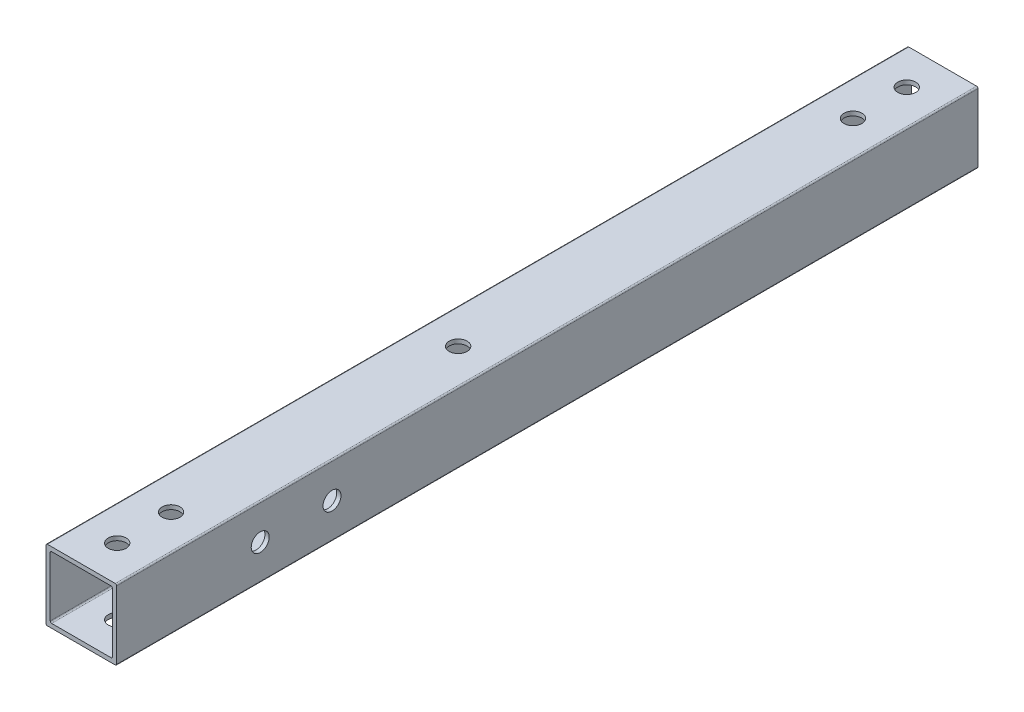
ISO-10303-21;
HEADER;
FILE_DESCRIPTION(('STEP AP214'),'2;1');
FILE_NAME('part.step','',(''),(''),'','','');
FILE_SCHEMA(('AUTOMOTIVE_DESIGN { 1 0 10303 214 1 1 1 1 }'));
ENDSEC;
DATA;
#1=APPLICATION_CONTEXT('core data for automotive mechanical design processes');
#2=APPLICATION_PROTOCOL_DEFINITION('international standard','automotive_design',2000,#1);
#3=PRODUCT_CONTEXT('',#1,'mechanical');
#4=PRODUCT('Part','Part','',(#3));
#5=PRODUCT_RELATED_PRODUCT_CATEGORY('part','',(#4));
#6=PRODUCT_DEFINITION_FORMATION('','',#4);
#7=PRODUCT_DEFINITION_CONTEXT('part definition',#1,'design');
#8=PRODUCT_DEFINITION('design','',#6,#7);
#9=PRODUCT_DEFINITION_SHAPE('','',#8);
#10=(LENGTH_UNIT() NAMED_UNIT(*) SI_UNIT(.MILLI.,.METRE.));
#11=(NAMED_UNIT(*) PLANE_ANGLE_UNIT() SI_UNIT($,.RADIAN.));
#12=(NAMED_UNIT(*) SI_UNIT($,.STERADIAN.) SOLID_ANGLE_UNIT());
#13=UNCERTAINTY_MEASURE_WITH_UNIT(LENGTH_MEASURE(1.E-05),#10,'distance_accuracy_value','');
#14=(GEOMETRIC_REPRESENTATION_CONTEXT(3) GLOBAL_UNCERTAINTY_ASSIGNED_CONTEXT((#13)) GLOBAL_UNIT_ASSIGNED_CONTEXT((#10,
#11,#12)) REPRESENTATION_CONTEXT('',''));
#15=CARTESIAN_POINT('',(0.,0.,0.));
#16=DIRECTION('',(0.,0.,1.));
#17=DIRECTION('',(1.,0.,0.));
#18=AXIS2_PLACEMENT_3D('',#15,#16,#17);
#19=CARTESIAN_POINT('',(-11.9999999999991,-11.9999999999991,-1695.2));
#20=DIRECTION('',(0.,0.,-1.));
#21=DIRECTION('',(-1.,0.,0.));
#22=AXIS2_PLACEMENT_3D('',#19,#20,#21);
#23=CYLINDRICAL_SURFACE('',#22,0.500000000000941);
#24=CARTESIAN_POINT('',(-11.9999999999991,-11.9999999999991,-2000.));
#25=DIRECTION('',(0.,0.,-1.));
#26=DIRECTION('',(-1.,0.,0.));
#27=AXIS2_PLACEMENT_3D('',#24,#25,#26);
#28=CIRCLE('',#27,0.500000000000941);
#29=CARTESIAN_POINT('',(-11.9999999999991,-12.5,-2000.));
#30=VERTEX_POINT('',#29);
#31=CARTESIAN_POINT('',(-12.5,-11.9999999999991,-2000.));
#32=VERTEX_POINT('',#31);
#33=EDGE_CURVE('E217',#30,#32,#28,.T.);
#34=ORIENTED_EDGE('',*,*,#33,.F.);
#35=DIRECTION('',(0.,0.,-1.));
#36=VECTOR('',#35,1.);
#37=CARTESIAN_POINT('',(-11.9999999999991,-12.5,-1695.2));
#38=LINE('',#37,#36);
#39=CARTESIAN_POINT('',(-11.9999999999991,-12.5,-1695.2));
#40=VERTEX_POINT('',#39);
#41=EDGE_CURVE('E11',#40,#30,#38,.T.);
#42=ORIENTED_EDGE('',*,*,#41,.F.);
#43=CARTESIAN_POINT('',(-11.9999999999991,-11.9999999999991,-1695.2));
#44=DIRECTION('',(0.,0.,-1.));
#45=DIRECTION('',(-1.,0.,0.));
#46=AXIS2_PLACEMENT_3D('',#43,#44,#45);
#47=CIRCLE('',#46,0.500000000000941);
#48=CARTESIAN_POINT('',(-12.5,-11.9999999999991,-1695.2));
#49=VERTEX_POINT('',#48);
#50=EDGE_CURVE('E229',#40,#49,#47,.T.);
#51=ORIENTED_EDGE('',*,*,#50,.T.);
#52=DIRECTION('',(0.,0.,-1.));
#53=VECTOR('',#52,1.);
#54=CARTESIAN_POINT('',(-12.5,-11.9999999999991,-1695.2));
#55=LINE('',#54,#53);
#56=EDGE_CURVE('E254',#49,#32,#55,.T.);
#57=ORIENTED_EDGE('',*,*,#56,.T.);
#58=EDGE_LOOP('',(#34,#42,#51,#57));
#59=FACE_BOUND('',#58,.T.);
#60=ADVANCED_FACE('F44',(#59),#23,.T.);
#61=CARTESIAN_POINT('',(11.9999999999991,-12.5,-1695.2));
#62=DIRECTION('',(0.,-1.,0.));
#63=DIRECTION('',(1.,0.,0.));
#64=AXIS2_PLACEMENT_3D('',#61,#62,#63);
#65=PLANE('',#64);
#66=CARTESIAN_POINT('',(0.,-12.5,-1828.55));
#67=DIRECTION('',(0.,-1.,0.));
#68=DIRECTION('',(1.,0.,0.));
#69=AXIS2_PLACEMENT_3D('',#66,#67,#68);
#70=CIRCLE('',#69,3.17500000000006);
#71=CARTESIAN_POINT('',(3.17500000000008,-12.5,-1828.55));
#72=VERTEX_POINT('',#71);
#73=EDGE_CURVE('E455',#72,#72,#70,.F.);
#74=ORIENTED_EDGE('',*,*,#73,.T.);
#75=EDGE_LOOP('',(#74));
#76=FACE_BOUND('',#75,.T.);
#77=CARTESIAN_POINT('',(0.,-12.5,-1987.3));
#78=DIRECTION('',(0.,-1.,0.));
#79=DIRECTION('',(1.,0.,0.));
#80=AXIS2_PLACEMENT_3D('',#77,#78,#79);
#81=CIRCLE('',#80,3.17500000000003);
#82=CARTESIAN_POINT('',(3.17500000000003,-12.5,-1987.3));
#83=VERTEX_POINT('',#82);
#84=EDGE_CURVE('E293',#83,#83,#81,.F.);
#85=ORIENTED_EDGE('',*,*,#84,.T.);
#86=EDGE_LOOP('',(#85));
#87=FACE_BOUND('',#86,.T.);
#88=CARTESIAN_POINT('',(0.,-12.5,-1726.95));
#89=DIRECTION('',(0.,-1.,0.));
#90=DIRECTION('',(1.,0.,0.));
#91=AXIS2_PLACEMENT_3D('',#88,#89,#90);
#92=CIRCLE('',#91,3.17500000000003);
#93=CARTESIAN_POINT('',(3.17500000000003,-12.5,-1726.95));
#94=VERTEX_POINT('',#93);
#95=EDGE_CURVE('E315',#94,#94,#92,.F.);
#96=ORIENTED_EDGE('',*,*,#95,.T.);
#97=EDGE_LOOP('',(#96));
#98=FACE_BOUND('',#97,.T.);
#99=CARTESIAN_POINT('',(0.,-12.5,-1707.9));
#100=DIRECTION('',(0.,-1.,0.));
#101=DIRECTION('',(1.,0.,0.));
#102=AXIS2_PLACEMENT_3D('',#99,#100,#101);
#103=CIRCLE('',#102,3.17500000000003);
#104=CARTESIAN_POINT('',(3.17500000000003,-12.5,-1707.9));
#105=VERTEX_POINT('',#104);
#106=EDGE_CURVE('E336',#105,#105,#103,.F.);
#107=ORIENTED_EDGE('',*,*,#106,.T.);
#108=EDGE_LOOP('',(#107));
#109=FACE_BOUND('',#108,.T.);
#110=CARTESIAN_POINT('',(0.,-12.5,-1968.25));
#111=DIRECTION('',(0.,-1.,0.));
#112=DIRECTION('',(1.,0.,0.));
#113=AXIS2_PLACEMENT_3D('',#110,#111,#112);
#114=CIRCLE('',#113,3.17500000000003);
#115=CARTESIAN_POINT('',(3.17500000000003,-12.5,-1968.25));
#116=VERTEX_POINT('',#115);
#117=EDGE_CURVE('E337',#116,#116,#114,.F.);
#118=ORIENTED_EDGE('',*,*,#117,.T.);
#119=EDGE_LOOP('',(#118));
#120=FACE_BOUND('',#119,.T.);
#121=DIRECTION('',(-1.,0.,0.));
#122=VECTOR('',#121,1.);
#123=CARTESIAN_POINT('',(11.9999999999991,-12.5,-2000.));
#124=LINE('',#123,#122);
#125=CARTESIAN_POINT('',(11.9999999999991,-12.5,-2000.));
#126=VERTEX_POINT('',#125);
#127=EDGE_CURVE('E233',#126,#30,#124,.T.);
#128=ORIENTED_EDGE('',*,*,#127,.F.);
#129=DIRECTION('',(0.,0.,-1.));
#130=VECTOR('',#129,1.);
#131=CARTESIAN_POINT('',(11.9999999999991,-12.5,-1695.2));
#132=LINE('',#131,#130);
#133=CARTESIAN_POINT('',(11.9999999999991,-12.5,-1695.2));
#134=VERTEX_POINT('',#133);
#135=EDGE_CURVE('E52',#134,#126,#132,.T.);
#136=ORIENTED_EDGE('',*,*,#135,.F.);
#137=DIRECTION('',(-1.,0.,0.));
#138=VECTOR('',#137,1.);
#139=CARTESIAN_POINT('',(11.9999999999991,-12.5,-1695.2));
#140=LINE('',#139,#138);
#141=EDGE_CURVE('E251',#134,#40,#140,.T.);
#142=ORIENTED_EDGE('',*,*,#141,.T.);
#143=ORIENTED_EDGE('',*,*,#41,.T.);
#144=EDGE_LOOP('',(#128,#136,#142,#143));
#145=FACE_BOUND('',#144,.T.);
#146=ADVANCED_FACE('F380',(#76,#87,#98,#109,#120,#145),#65,.T.);
#147=CARTESIAN_POINT('',(11.9999999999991,-11.9999999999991,-1695.2));
#148=DIRECTION('',(0.,0.,-1.));
#149=DIRECTION('',(-1.,0.,0.));
#150=AXIS2_PLACEMENT_3D('',#147,#148,#149);
#151=CYLINDRICAL_SURFACE('',#150,0.500000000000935);
#152=CARTESIAN_POINT('',(11.9999999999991,-11.9999999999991,-2000.));
#153=DIRECTION('',(0.,0.,-1.));
#154=DIRECTION('',(-1.,0.,0.));
#155=AXIS2_PLACEMENT_3D('',#152,#153,#154);
#156=CIRCLE('',#155,0.500000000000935);
#157=CARTESIAN_POINT('',(12.5,-11.9999999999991,-2000.));
#158=VERTEX_POINT('',#157);
#159=EDGE_CURVE('E272',#158,#126,#156,.T.);
#160=ORIENTED_EDGE('',*,*,#159,.F.);
#161=DIRECTION('',(0.,0.,-1.));
#162=VECTOR('',#161,1.);
#163=CARTESIAN_POINT('',(12.5,-11.9999999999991,-1695.2));
#164=LINE('',#163,#162);
#165=CARTESIAN_POINT('',(12.5,-11.9999999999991,-1695.2));
#166=VERTEX_POINT('',#165);
#167=EDGE_CURVE('E278',#166,#158,#164,.T.);
#168=ORIENTED_EDGE('',*,*,#167,.F.);
#169=CARTESIAN_POINT('',(11.9999999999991,-11.9999999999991,-1695.2));
#170=DIRECTION('',(0.,0.,-1.));
#171=DIRECTION('',(-1.,0.,0.));
#172=AXIS2_PLACEMENT_3D('',#169,#170,#171);
#173=CIRCLE('',#172,0.500000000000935);
#174=EDGE_CURVE('E248',#166,#134,#173,.T.);
#175=ORIENTED_EDGE('',*,*,#174,.T.);
#176=ORIENTED_EDGE('',*,*,#135,.T.);
#177=EDGE_LOOP('',(#160,#168,#175,#176));
#178=FACE_BOUND('',#177,.T.);
#179=ADVANCED_FACE('F385',(#178),#151,.T.);
#180=CARTESIAN_POINT('',(12.5,11.9999999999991,-1695.2));
#181=DIRECTION('',(1.,0.,0.));
#182=DIRECTION('',(0.,1.,0.));
#183=AXIS2_PLACEMENT_3D('',#180,#181,#182);
#184=PLANE('',#183);
#185=CARTESIAN_POINT('',(12.5,0.,-1771.4));
#186=DIRECTION('',(1.,0.,0.));
#187=DIRECTION('',(0.,1.,0.));
#188=AXIS2_PLACEMENT_3D('',#185,#186,#187);
#189=CIRCLE('',#188,3.17499999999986);
#190=CARTESIAN_POINT('',(12.5,3.17499999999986,-1771.4));
#191=VERTEX_POINT('',#190);
#192=EDGE_CURVE('E448',#191,#191,#189,.T.);
#193=ORIENTED_EDGE('',*,*,#192,.F.);
#194=EDGE_LOOP('',(#193));
#195=FACE_BOUND('',#194,.T.);
#196=CARTESIAN_POINT('',(12.5,0.,-1746.));
#197=DIRECTION('',(1.,0.,0.));
#198=DIRECTION('',(0.,1.,0.));
#199=AXIS2_PLACEMENT_3D('',#196,#197,#198);
#200=CIRCLE('',#199,3.17499999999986);
#201=CARTESIAN_POINT('',(12.5,3.17499999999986,-1746.));
#202=VERTEX_POINT('',#201);
#203=EDGE_CURVE('E322',#202,#202,#200,.T.);
#204=ORIENTED_EDGE('',*,*,#203,.F.);
#205=EDGE_LOOP('',(#204));
#206=FACE_BOUND('',#205,.T.);
#207=DIRECTION('',(0.,-1.,0.));
#208=VECTOR('',#207,1.);
#209=CARTESIAN_POINT('',(12.5,11.9999999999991,-2000.));
#210=LINE('',#209,#208);
#211=CARTESIAN_POINT('',(12.5,11.9999999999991,-2000.));
#212=VERTEX_POINT('',#211);
#213=EDGE_CURVE('E269',#212,#158,#210,.T.);
#214=ORIENTED_EDGE('',*,*,#213,.F.);
#215=DIRECTION('',(0.,0.,-1.));
#216=VECTOR('',#215,1.);
#217=CARTESIAN_POINT('',(12.5,11.9999999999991,-1695.2));
#218=LINE('',#217,#216);
#219=CARTESIAN_POINT('',(12.5,11.9999999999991,-1695.2));
#220=VERTEX_POINT('',#219);
#221=EDGE_CURVE('E280',#220,#212,#218,.T.);
#222=ORIENTED_EDGE('',*,*,#221,.F.);
#223=DIRECTION('',(0.,-1.,0.));
#224=VECTOR('',#223,1.);
#225=CARTESIAN_POINT('',(12.5,11.9999999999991,-1695.2));
#226=LINE('',#225,#224);
#227=EDGE_CURVE('E245',#220,#166,#226,.T.);
#228=ORIENTED_EDGE('',*,*,#227,.T.);
#229=ORIENTED_EDGE('',*,*,#167,.T.);
#230=EDGE_LOOP('',(#214,#222,#228,#229));
#231=FACE_BOUND('',#230,.T.);
#232=ADVANCED_FACE('F416',(#195,#206,#231),#184,.T.);
#233=CARTESIAN_POINT('',(11.9999999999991,11.9999999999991,-1695.2));
#234=DIRECTION('',(0.,0.,-1.));
#235=DIRECTION('',(-1.,0.,0.));
#236=AXIS2_PLACEMENT_3D('',#233,#234,#235);
#237=CYLINDRICAL_SURFACE('',#236,0.500000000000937);
#238=CARTESIAN_POINT('',(11.9999999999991,11.9999999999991,-2000.));
#239=DIRECTION('',(0.,0.,-1.));
#240=DIRECTION('',(-1.,0.,0.));
#241=AXIS2_PLACEMENT_3D('',#238,#239,#240);
#242=CIRCLE('',#241,0.500000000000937);
#243=CARTESIAN_POINT('',(11.9999999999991,12.5,-2000.));
#244=VERTEX_POINT('',#243);
#245=EDGE_CURVE('E266',#244,#212,#242,.T.);
#246=ORIENTED_EDGE('',*,*,#245,.F.);
#247=DIRECTION('',(0.,0.,-1.));
#248=VECTOR('',#247,1.);
#249=CARTESIAN_POINT('',(11.9999999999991,12.5,-1695.2));
#250=LINE('',#249,#248);
#251=CARTESIAN_POINT('',(11.9999999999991,12.5,-1695.2));
#252=VERTEX_POINT('',#251);
#253=EDGE_CURVE('E282',#252,#244,#250,.T.);
#254=ORIENTED_EDGE('',*,*,#253,.F.);
#255=CARTESIAN_POINT('',(11.9999999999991,11.9999999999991,-1695.2));
#256=DIRECTION('',(0.,0.,-1.));
#257=DIRECTION('',(-1.,0.,0.));
#258=AXIS2_PLACEMENT_3D('',#255,#256,#257);
#259=CIRCLE('',#258,0.500000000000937);
#260=EDGE_CURVE('E242',#252,#220,#259,.T.);
#261=ORIENTED_EDGE('',*,*,#260,.T.);
#262=ORIENTED_EDGE('',*,*,#221,.T.);
#263=EDGE_LOOP('',(#246,#254,#261,#262));
#264=FACE_BOUND('',#263,.T.);
#265=ADVANCED_FACE('F413',(#264),#237,.T.);
#266=CARTESIAN_POINT('',(-11.9999999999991,12.5,-1695.2));
#267=DIRECTION('',(0.,1.,0.));
#268=DIRECTION('',(-1.,0.,0.));
#269=AXIS2_PLACEMENT_3D('',#266,#267,#268);
#270=PLANE('',#269);
#271=CARTESIAN_POINT('',(0.,12.5,-1828.55));
#272=DIRECTION('',(0.,1.,0.));
#273=DIRECTION('',(-1.,0.,0.));
#274=AXIS2_PLACEMENT_3D('',#271,#272,#273);
#275=CIRCLE('',#274,3.17500000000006);
#276=CARTESIAN_POINT('',(-3.17500000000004,12.5,-1828.55));
#277=VERTEX_POINT('',#276);
#278=EDGE_CURVE('E458',#277,#277,#275,.T.);
#279=ORIENTED_EDGE('',*,*,#278,.F.);
#280=EDGE_LOOP('',(#279));
#281=FACE_BOUND('',#280,.T.);
#282=CARTESIAN_POINT('',(0.,12.5,-1987.3));
#283=DIRECTION('',(0.,1.,0.));
#284=DIRECTION('',(-1.,0.,0.));
#285=AXIS2_PLACEMENT_3D('',#282,#283,#284);
#286=CIRCLE('',#285,3.17500000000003);
#287=CARTESIAN_POINT('',(-3.17500000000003,12.5,-1987.3));
#288=VERTEX_POINT('',#287);
#289=EDGE_CURVE('E325',#288,#288,#286,.T.);
#290=ORIENTED_EDGE('',*,*,#289,.F.);
#291=EDGE_LOOP('',(#290));
#292=FACE_BOUND('',#291,.T.);
#293=CARTESIAN_POINT('',(0.,12.5,-1726.95));
#294=DIRECTION('',(0.,1.,0.));
#295=DIRECTION('',(1.,0.,0.));
#296=AXIS2_PLACEMENT_3D('',#293,#294,#295);
#297=CIRCLE('',#296,3.17500000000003);
#298=CARTESIAN_POINT('',(3.17500000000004,12.5,-1726.95));
#299=VERTEX_POINT('',#298);
#300=EDGE_CURVE('E333',#299,#299,#297,.T.);
#301=ORIENTED_EDGE('',*,*,#300,.F.);
#302=EDGE_LOOP('',(#301));
#303=FACE_BOUND('',#302,.T.);
#304=CARTESIAN_POINT('',(0.,12.5,-1707.9));
#305=DIRECTION('',(0.,1.,0.));
#306=DIRECTION('',(1.,0.,0.));
#307=AXIS2_PLACEMENT_3D('',#304,#305,#306);
#308=CIRCLE('',#307,3.17500000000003);
#309=CARTESIAN_POINT('',(3.17500000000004,12.5,-1707.9));
#310=VERTEX_POINT('',#309);
#311=EDGE_CURVE('E340',#310,#310,#308,.T.);
#312=ORIENTED_EDGE('',*,*,#311,.F.);
#313=EDGE_LOOP('',(#312));
#314=FACE_BOUND('',#313,.T.);
#315=CARTESIAN_POINT('',(0.,12.5,-1968.25));
#316=DIRECTION('',(0.,1.,0.));
#317=DIRECTION('',(-1.,0.,0.));
#318=AXIS2_PLACEMENT_3D('',#315,#316,#317);
#319=CIRCLE('',#318,3.17500000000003);
#320=CARTESIAN_POINT('',(-3.17500000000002,12.5,-1968.25));
#321=VERTEX_POINT('',#320);
#322=EDGE_CURVE('E328',#321,#321,#319,.T.);
#323=ORIENTED_EDGE('',*,*,#322,.F.);
#324=EDGE_LOOP('',(#323));
#325=FACE_BOUND('',#324,.T.);
#326=DIRECTION('',(1.,0.,0.));
#327=VECTOR('',#326,1.);
#328=CARTESIAN_POINT('',(-11.9999999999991,12.5,-2000.));
#329=LINE('',#328,#327);
#330=CARTESIAN_POINT('',(-11.9999999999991,12.5,-2000.));
#331=VERTEX_POINT('',#330);
#332=EDGE_CURVE('E263',#331,#244,#329,.T.);
#333=ORIENTED_EDGE('',*,*,#332,.F.);
#334=DIRECTION('',(0.,0.,-1.));
#335=VECTOR('',#334,1.);
#336=CARTESIAN_POINT('',(-11.9999999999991,12.5,-1695.2));
#337=LINE('',#336,#335);
#338=CARTESIAN_POINT('',(-11.9999999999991,12.5,-1695.2));
#339=VERTEX_POINT('',#338);
#340=EDGE_CURVE('E284',#339,#331,#337,.T.);
#341=ORIENTED_EDGE('',*,*,#340,.F.);
#342=DIRECTION('',(1.,0.,0.));
#343=VECTOR('',#342,1.);
#344=CARTESIAN_POINT('',(-11.9999999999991,12.5,-1695.2));
#345=LINE('',#344,#343);
#346=EDGE_CURVE('E239',#339,#252,#345,.T.);
#347=ORIENTED_EDGE('',*,*,#346,.T.);
#348=ORIENTED_EDGE('',*,*,#253,.T.);
#349=EDGE_LOOP('',(#333,#341,#347,#348));
#350=FACE_BOUND('',#349,.T.);
#351=ADVANCED_FACE('F409',(#281,#292,#303,#314,#325,#350),#270,.T.);
#352=CARTESIAN_POINT('',(-11.9999999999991,11.9999999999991,-1695.2));
#353=DIRECTION('',(0.,0.,-1.));
#354=DIRECTION('',(-1.,0.,0.));
#355=AXIS2_PLACEMENT_3D('',#352,#353,#354);
#356=CYLINDRICAL_SURFACE('',#355,0.500000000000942);
#357=CARTESIAN_POINT('',(-11.9999999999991,11.9999999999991,-2000.));
#358=DIRECTION('',(0.,0.,-1.));
#359=DIRECTION('',(-1.,0.,0.));
#360=AXIS2_PLACEMENT_3D('',#357,#358,#359);
#361=CIRCLE('',#360,0.500000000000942);
#362=CARTESIAN_POINT('',(-12.5,11.9999999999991,-2000.));
#363=VERTEX_POINT('',#362);
#364=EDGE_CURVE('E260',#363,#331,#361,.T.);
#365=ORIENTED_EDGE('',*,*,#364,.F.);
#366=DIRECTION('',(0.,0.,-1.));
#367=VECTOR('',#366,1.);
#368=CARTESIAN_POINT('',(-12.5,11.9999999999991,-1695.2));
#369=LINE('',#368,#367);
#370=CARTESIAN_POINT('',(-12.5,11.9999999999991,-1695.2));
#371=VERTEX_POINT('',#370);
#372=EDGE_CURVE('E286',#371,#363,#369,.T.);
#373=ORIENTED_EDGE('',*,*,#372,.F.);
#374=CARTESIAN_POINT('',(-11.9999999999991,11.9999999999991,-1695.2));
#375=DIRECTION('',(0.,0.,-1.));
#376=DIRECTION('',(-1.,0.,0.));
#377=AXIS2_PLACEMENT_3D('',#374,#375,#376);
#378=CIRCLE('',#377,0.500000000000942);
#379=EDGE_CURVE('E236',#371,#339,#378,.T.);
#380=ORIENTED_EDGE('',*,*,#379,.T.);
#381=ORIENTED_EDGE('',*,*,#340,.T.);
#382=EDGE_LOOP('',(#365,#373,#380,#381));
#383=FACE_BOUND('',#382,.T.);
#384=ADVANCED_FACE('F407',(#383),#356,.T.);
#385=CARTESIAN_POINT('',(-12.5,-11.9999999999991,-1695.2));
#386=DIRECTION('',(-1.,0.,0.));
#387=DIRECTION('',(0.,0.,1.));
#388=AXIS2_PLACEMENT_3D('',#385,#386,#387);
#389=PLANE('',#388);
#390=CARTESIAN_POINT('',(-12.5,0.,-1771.4));
#391=DIRECTION('',(-1.,0.,0.));
#392=DIRECTION('',(0.,0.,1.));
#393=AXIS2_PLACEMENT_3D('',#390,#391,#392);
#394=CIRCLE('',#393,3.17499999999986);
#395=CARTESIAN_POINT('',(-12.5,3.17499999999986,-1771.4));
#396=VERTEX_POINT('',#395);
#397=EDGE_CURVE('E308',#396,#396,#394,.F.);
#398=ORIENTED_EDGE('',*,*,#397,.T.);
#399=EDGE_LOOP('',(#398));
#400=FACE_BOUND('',#399,.T.);
#401=CARTESIAN_POINT('',(-12.5,0.,-1746.));
#402=DIRECTION('',(-1.,0.,0.));
#403=DIRECTION('',(0.,0.,1.));
#404=AXIS2_PLACEMENT_3D('',#401,#402,#403);
#405=CIRCLE('',#404,3.17499999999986);
#406=CARTESIAN_POINT('',(-12.5,3.17499999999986,-1746.));
#407=VERTEX_POINT('',#406);
#408=EDGE_CURVE('E444',#407,#407,#405,.F.);
#409=ORIENTED_EDGE('',*,*,#408,.T.);
#410=EDGE_LOOP('',(#409));
#411=FACE_BOUND('',#410,.T.);
#412=DIRECTION('',(0.,1.,0.));
#413=VECTOR('',#412,1.);
#414=CARTESIAN_POINT('',(-12.5,-11.9999999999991,-2000.));
#415=LINE('',#414,#413);
#416=EDGE_CURVE('E257',#32,#363,#415,.T.);
#417=ORIENTED_EDGE('',*,*,#416,.F.);
#418=ORIENTED_EDGE('',*,*,#56,.F.);
#419=DIRECTION('',(0.,1.,0.));
#420=VECTOR('',#419,1.);
#421=CARTESIAN_POINT('',(-12.5,-11.9999999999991,-1695.2));
#422=LINE('',#421,#420);
#423=EDGE_CURVE('E232',#49,#371,#422,.T.);
#424=ORIENTED_EDGE('',*,*,#423,.T.);
#425=ORIENTED_EDGE('',*,*,#372,.T.);
#426=EDGE_LOOP('',(#417,#418,#424,#425));
#427=FACE_BOUND('',#426,.T.);
#428=ADVANCED_FACE('F403',(#400,#411,#427),#389,.T.);
#429=CARTESIAN_POINT('',(-11.9999999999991,-11.9999999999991,-1695.2));
#430=DIRECTION('',(0.,0.,-1.));
#431=DIRECTION('',(-1.,0.,0.));
#432=AXIS2_PLACEMENT_3D('',#429,#430,#431);
#433=PLANE('',#432);
#434=DIRECTION('',(0.,1.,0.));
#435=VECTOR('',#434,1.);
#436=CARTESIAN_POINT('',(-11.,10.4999999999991,-1695.2));
#437=LINE('',#436,#435);
#438=CARTESIAN_POINT('',(-11.,-10.4999999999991,-1695.2));
#439=VERTEX_POINT('',#438);
#440=CARTESIAN_POINT('',(-11.,10.4999999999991,-1695.2));
#441=VERTEX_POINT('',#440);
#442=EDGE_CURVE('E165',#439,#441,#437,.T.);
#443=ORIENTED_EDGE('',*,*,#442,.T.);
#444=CARTESIAN_POINT('',(-10.4999999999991,10.4999999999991,-1695.2));
#445=DIRECTION('',(0.,0.,-1.));
#446=DIRECTION('',(1.,0.,0.));
#447=AXIS2_PLACEMENT_3D('',#444,#445,#446);
#448=CIRCLE('',#447,0.500000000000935);
#449=CARTESIAN_POINT('',(-10.4999999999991,11.,-1695.2));
#450=VERTEX_POINT('',#449);
#451=EDGE_CURVE('E159',#441,#450,#448,.T.);
#452=ORIENTED_EDGE('',*,*,#451,.T.);
#453=DIRECTION('',(1.,0.,0.));
#454=VECTOR('',#453,1.);
#455=CARTESIAN_POINT('',(10.4999999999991,11.,-1695.2));
#456=LINE('',#455,#454);
#457=CARTESIAN_POINT('',(10.4999999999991,11.,-1695.2));
#458=VERTEX_POINT('',#457);
#459=EDGE_CURVE('E168',#450,#458,#456,.T.);
#460=ORIENTED_EDGE('',*,*,#459,.T.);
#461=CARTESIAN_POINT('',(10.4999999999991,10.4999999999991,-1695.2));
#462=DIRECTION('',(0.,0.,-1.));
#463=DIRECTION('',(1.,0.,0.));
#464=AXIS2_PLACEMENT_3D('',#461,#462,#463);
#465=CIRCLE('',#464,0.500000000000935);
#466=CARTESIAN_POINT('',(11.,10.4999999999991,-1695.2));
#467=VERTEX_POINT('',#466);
#468=EDGE_CURVE('E60',#458,#467,#465,.T.);
#469=ORIENTED_EDGE('',*,*,#468,.T.);
#470=DIRECTION('',(0.,-1.,0.));
#471=VECTOR('',#470,1.);
#472=CARTESIAN_POINT('',(11.,-10.4999999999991,-1695.2));
#473=LINE('',#472,#471);
#474=CARTESIAN_POINT('',(11.,-10.4999999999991,-1695.2));
#475=VERTEX_POINT('',#474);
#476=EDGE_CURVE('E186',#467,#475,#473,.T.);
#477=ORIENTED_EDGE('',*,*,#476,.T.);
#478=CARTESIAN_POINT('',(10.4999999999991,-10.4999999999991,-1695.2));
#479=DIRECTION('',(0.,0.,-1.));
#480=DIRECTION('',(1.,0.,0.));
#481=AXIS2_PLACEMENT_3D('',#478,#479,#480);
#482=CIRCLE('',#481,0.500000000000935);
#483=CARTESIAN_POINT('',(10.4999999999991,-11.,-1695.2));
#484=VERTEX_POINT('',#483);
#485=EDGE_CURVE('E189',#475,#484,#482,.T.);
#486=ORIENTED_EDGE('',*,*,#485,.T.);
#487=DIRECTION('',(-1.,0.,0.));
#488=VECTOR('',#487,1.);
#489=CARTESIAN_POINT('',(-10.4999999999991,-11.,-1695.2));
#490=LINE('',#489,#488);
#491=CARTESIAN_POINT('',(-10.4999999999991,-11.,-1695.2));
#492=VERTEX_POINT('',#491);
#493=EDGE_CURVE('E192',#484,#492,#490,.T.);
#494=ORIENTED_EDGE('',*,*,#493,.T.);
#495=CARTESIAN_POINT('',(-10.4999999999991,-10.4999999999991,-1695.2));
#496=DIRECTION('',(0.,0.,-1.));
#497=DIRECTION('',(1.,0.,0.));
#498=AXIS2_PLACEMENT_3D('',#495,#496,#497);
#499=CIRCLE('',#498,0.500000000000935);
#500=EDGE_CURVE('E195',#492,#439,#499,.T.);
#501=ORIENTED_EDGE('',*,*,#500,.T.);
#502=EDGE_LOOP('',(#443,#452,#460,#469,#477,#486,#494,#501));
#503=FACE_BOUND('',#502,.T.);
#504=ORIENTED_EDGE('',*,*,#50,.F.);
#505=ORIENTED_EDGE('',*,*,#141,.F.);
#506=ORIENTED_EDGE('',*,*,#174,.F.);
#507=ORIENTED_EDGE('',*,*,#227,.F.);
#508=ORIENTED_EDGE('',*,*,#260,.F.);
#509=ORIENTED_EDGE('',*,*,#346,.F.);
#510=ORIENTED_EDGE('',*,*,#379,.F.);
#511=ORIENTED_EDGE('',*,*,#423,.F.);
#512=EDGE_LOOP('',(#504,#505,#506,#507,#508,#509,#510,#511));
#513=FACE_BOUND('',#512,.T.);
#514=ADVANCED_FACE('F172',(#503,#513),#433,.F.);
#515=CARTESIAN_POINT('',(-11.9999999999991,-11.9999999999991,-2000.));
#516=DIRECTION('',(0.,0.,-1.));
#517=DIRECTION('',(-1.,0.,0.));
#518=AXIS2_PLACEMENT_3D('',#515,#516,#517);
#519=PLANE('',#518);
#520=CARTESIAN_POINT('',(-10.4999999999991,10.4999999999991,-2000.));
#521=DIRECTION('',(0.,0.,-1.));
#522=DIRECTION('',(1.,0.,0.));
#523=AXIS2_PLACEMENT_3D('',#520,#521,#522);
#524=CIRCLE('',#523,0.500000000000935);
#525=CARTESIAN_POINT('',(-11.,10.4999999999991,-2000.));
#526=VERTEX_POINT('',#525);
#527=CARTESIAN_POINT('',(-10.4999999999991,11.,-2000.));
#528=VERTEX_POINT('',#527);
#529=EDGE_CURVE('E68',#526,#528,#524,.T.);
#530=ORIENTED_EDGE('',*,*,#529,.F.);
#531=DIRECTION('',(0.,1.,0.));
#532=VECTOR('',#531,1.);
#533=CARTESIAN_POINT('',(-11.,10.4999999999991,-2000.));
#534=LINE('',#533,#532);
#535=CARTESIAN_POINT('',(-11.,-10.4999999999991,-2000.));
#536=VERTEX_POINT('',#535);
#537=EDGE_CURVE('E176',#536,#526,#534,.T.);
#538=ORIENTED_EDGE('',*,*,#537,.F.);
#539=CARTESIAN_POINT('',(-10.4999999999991,-10.4999999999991,-2000.));
#540=DIRECTION('',(0.,0.,-1.));
#541=DIRECTION('',(1.,0.,0.));
#542=AXIS2_PLACEMENT_3D('',#539,#540,#541);
#543=CIRCLE('',#542,0.500000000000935);
#544=CARTESIAN_POINT('',(-10.4999999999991,-11.,-2000.));
#545=VERTEX_POINT('',#544);
#546=EDGE_CURVE('E179',#545,#536,#543,.T.);
#547=ORIENTED_EDGE('',*,*,#546,.F.);
#548=DIRECTION('',(-1.,0.,0.));
#549=VECTOR('',#548,1.);
#550=CARTESIAN_POINT('',(-10.4999999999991,-11.,-2000.));
#551=LINE('',#550,#549);
#552=CARTESIAN_POINT('',(10.4999999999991,-11.,-2000.));
#553=VERTEX_POINT('',#552);
#554=EDGE_CURVE('E210',#553,#545,#551,.T.);
#555=ORIENTED_EDGE('',*,*,#554,.F.);
#556=CARTESIAN_POINT('',(10.4999999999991,-10.4999999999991,-2000.));
#557=DIRECTION('',(0.,0.,-1.));
#558=DIRECTION('',(1.,0.,0.));
#559=AXIS2_PLACEMENT_3D('',#556,#557,#558);
#560=CIRCLE('',#559,0.500000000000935);
#561=CARTESIAN_POINT('',(11.,-10.4999999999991,-2000.));
#562=VERTEX_POINT('',#561);
#563=EDGE_CURVE('E207',#562,#553,#560,.T.);
#564=ORIENTED_EDGE('',*,*,#563,.F.);
#565=DIRECTION('',(0.,-1.,0.));
#566=VECTOR('',#565,1.);
#567=CARTESIAN_POINT('',(11.,-10.4999999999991,-2000.));
#568=LINE('',#567,#566);
#569=CARTESIAN_POINT('',(11.,10.4999999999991,-2000.));
#570=VERTEX_POINT('',#569);
#571=EDGE_CURVE('E204',#570,#562,#568,.T.);
#572=ORIENTED_EDGE('',*,*,#571,.F.);
#573=CARTESIAN_POINT('',(10.4999999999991,10.4999999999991,-2000.));
#574=DIRECTION('',(0.,0.,-1.));
#575=DIRECTION('',(1.,0.,0.));
#576=AXIS2_PLACEMENT_3D('',#573,#574,#575);
#577=CIRCLE('',#576,0.500000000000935);
#578=CARTESIAN_POINT('',(10.4999999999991,11.,-2000.));
#579=VERTEX_POINT('',#578);
#580=EDGE_CURVE('E201',#579,#570,#577,.T.);
#581=ORIENTED_EDGE('',*,*,#580,.F.);
#582=DIRECTION('',(1.,0.,0.));
#583=VECTOR('',#582,1.);
#584=CARTESIAN_POINT('',(10.4999999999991,11.,-2000.));
#585=LINE('',#584,#583);
#586=EDGE_CURVE('E199',#528,#579,#585,.T.);
#587=ORIENTED_EDGE('',*,*,#586,.F.);
#588=EDGE_LOOP('',(#530,#538,#547,#555,#564,#572,#581,#587));
#589=FACE_BOUND('',#588,.T.);
#590=ORIENTED_EDGE('',*,*,#33,.T.);
#591=ORIENTED_EDGE('',*,*,#416,.T.);
#592=ORIENTED_EDGE('',*,*,#364,.T.);
#593=ORIENTED_EDGE('',*,*,#332,.T.);
#594=ORIENTED_EDGE('',*,*,#245,.T.);
#595=ORIENTED_EDGE('',*,*,#213,.T.);
#596=ORIENTED_EDGE('',*,*,#159,.T.);
#597=ORIENTED_EDGE('',*,*,#127,.T.);
#598=EDGE_LOOP('',(#590,#591,#592,#593,#594,#595,#596,#597));
#599=FACE_BOUND('',#598,.T.);
#600=ADVANCED_FACE('F393',(#589,#599),#519,.T.);
#601=CARTESIAN_POINT('',(-10.4999999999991,10.4999999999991,-1695.2));
#602=DIRECTION('',(0.,0.,-1.));
#603=DIRECTION('',(-1.,0.,0.));
#604=AXIS2_PLACEMENT_3D('',#601,#602,#603);
#605=CYLINDRICAL_SURFACE('',#604,0.500000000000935);
#606=ORIENTED_EDGE('',*,*,#529,.T.);
#607=DIRECTION('',(0.,0.,-1.));
#608=VECTOR('',#607,1.);
#609=CARTESIAN_POINT('',(-10.4999999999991,11.,-1695.2));
#610=LINE('',#609,#608);
#611=EDGE_CURVE('E155',#450,#528,#610,.T.);
#612=ORIENTED_EDGE('',*,*,#611,.F.);
#613=ORIENTED_EDGE('',*,*,#451,.F.);
#614=DIRECTION('',(0.,0.,-1.));
#615=VECTOR('',#614,1.);
#616=CARTESIAN_POINT('',(-11.,10.4999999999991,-1695.2));
#617=LINE('',#616,#615);
#618=EDGE_CURVE('E215',#441,#526,#617,.T.);
#619=ORIENTED_EDGE('',*,*,#618,.T.);
#620=EDGE_LOOP('',(#606,#612,#613,#619));
#621=FACE_BOUND('',#620,.T.);
#622=ADVANCED_FACE('F157',(#621),#605,.F.);
#623=CARTESIAN_POINT('',(-11.,10.4999999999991,-1695.2));
#624=DIRECTION('',(-1.,0.,0.));
#625=DIRECTION('',(0.,-1.,0.));
#626=AXIS2_PLACEMENT_3D('',#623,#624,#625);
#627=PLANE('',#626);
#628=CARTESIAN_POINT('',(-11.,0.,-1771.4));
#629=DIRECTION('',(-1.,0.,0.));
#630=DIRECTION('',(0.,-1.,0.));
#631=AXIS2_PLACEMENT_3D('',#628,#629,#630);
#632=CIRCLE('',#631,3.17499999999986);
#633=CARTESIAN_POINT('',(-11.,3.17499999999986,-1771.4));
#634=VERTEX_POINT('',#633);
#635=EDGE_CURVE('E311',#634,#634,#632,.T.);
#636=ORIENTED_EDGE('',*,*,#635,.T.);
#637=EDGE_LOOP('',(#636));
#638=FACE_BOUND('',#637,.T.);
#639=CARTESIAN_POINT('',(-11.,0.,-1746.));
#640=DIRECTION('',(-1.,0.,0.));
#641=DIRECTION('',(0.,-1.,0.));
#642=AXIS2_PLACEMENT_3D('',#639,#640,#641);
#643=CIRCLE('',#642,3.17499999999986);
#644=CARTESIAN_POINT('',(-11.,3.17499999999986,-1746.));
#645=VERTEX_POINT('',#644);
#646=EDGE_CURVE('E307',#645,#645,#643,.T.);
#647=ORIENTED_EDGE('',*,*,#646,.T.);
#648=EDGE_LOOP('',(#647));
#649=FACE_BOUND('',#648,.T.);
#650=ORIENTED_EDGE('',*,*,#537,.T.);
#651=ORIENTED_EDGE('',*,*,#618,.F.);
#652=ORIENTED_EDGE('',*,*,#442,.F.);
#653=DIRECTION('',(0.,0.,-1.));
#654=VECTOR('',#653,1.);
#655=CARTESIAN_POINT('',(-11.,-10.4999999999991,-1695.2));
#656=LINE('',#655,#654);
#657=EDGE_CURVE('E218',#439,#536,#656,.T.);
#658=ORIENTED_EDGE('',*,*,#657,.T.);
#659=EDGE_LOOP('',(#650,#651,#652,#658));
#660=FACE_BOUND('',#659,.T.);
#661=ADVANCED_FACE('F492',(#638,#649,#660),#627,.F.);
#662=CARTESIAN_POINT('',(-10.4999999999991,-10.4999999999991,-1695.2));
#663=DIRECTION('',(0.,0.,-1.));
#664=DIRECTION('',(-1.,0.,0.));
#665=AXIS2_PLACEMENT_3D('',#662,#663,#664);
#666=CYLINDRICAL_SURFACE('',#665,0.500000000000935);
#667=ORIENTED_EDGE('',*,*,#546,.T.);
#668=ORIENTED_EDGE('',*,*,#657,.F.);
#669=ORIENTED_EDGE('',*,*,#500,.F.);
#670=DIRECTION('',(0.,0.,-1.));
#671=VECTOR('',#670,1.);
#672=CARTESIAN_POINT('',(-10.4999999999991,-11.,-1695.2));
#673=LINE('',#672,#671);
#674=EDGE_CURVE('E220',#492,#545,#673,.T.);
#675=ORIENTED_EDGE('',*,*,#674,.T.);
#676=EDGE_LOOP('',(#667,#668,#669,#675));
#677=FACE_BOUND('',#676,.T.);
#678=ADVANCED_FACE('F512',(#677),#666,.F.);
#679=CARTESIAN_POINT('',(-10.4999999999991,-11.,-1695.2));
#680=DIRECTION('',(0.,-1.,0.));
#681=DIRECTION('',(0.,0.,-1.));
#682=AXIS2_PLACEMENT_3D('',#679,#680,#681);
#683=PLANE('',#682);
#684=CARTESIAN_POINT('',(0.,-11.,-1828.55));
#685=DIRECTION('',(0.,-1.,0.));
#686=DIRECTION('',(0.,0.,-1.));
#687=AXIS2_PLACEMENT_3D('',#684,#685,#686);
#688=CIRCLE('',#687,3.17500000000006);
#689=CARTESIAN_POINT('',(0.,-11.,-1831.725));
#690=VERTEX_POINT('',#689);
#691=EDGE_CURVE('E446',#690,#690,#688,.T.);
#692=ORIENTED_EDGE('',*,*,#691,.T.);
#693=EDGE_LOOP('',(#692));
#694=FACE_BOUND('',#693,.T.);
#695=CARTESIAN_POINT('',(0.,-11.,-1987.3));
#696=DIRECTION('',(0.,-1.,0.));
#697=DIRECTION('',(0.,0.,-1.));
#698=AXIS2_PLACEMENT_3D('',#695,#696,#697);
#699=CIRCLE('',#698,3.17500000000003);
#700=CARTESIAN_POINT('',(0.,-11.,-1990.475));
#701=VERTEX_POINT('',#700);
#702=EDGE_CURVE('E182',#701,#701,#699,.T.);
#703=ORIENTED_EDGE('',*,*,#702,.T.);
#704=EDGE_LOOP('',(#703));
#705=FACE_BOUND('',#704,.T.);
#706=CARTESIAN_POINT('',(0.,-11.,-1726.95));
#707=DIRECTION('',(0.,-1.,0.));
#708=DIRECTION('',(0.,0.,-1.));
#709=AXIS2_PLACEMENT_3D('',#706,#707,#708);
#710=CIRCLE('',#709,3.17500000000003);
#711=CARTESIAN_POINT('',(0.,-11.,-1730.125));
#712=VERTEX_POINT('',#711);
#713=EDGE_CURVE('E301',#712,#712,#710,.T.);
#714=ORIENTED_EDGE('',*,*,#713,.T.);
#715=EDGE_LOOP('',(#714));
#716=FACE_BOUND('',#715,.T.);
#717=CARTESIAN_POINT('',(0.,-11.,-1707.9));
#718=DIRECTION('',(0.,-1.,0.));
#719=DIRECTION('',(0.,0.,-1.));
#720=AXIS2_PLACEMENT_3D('',#717,#718,#719);
#721=CIRCLE('',#720,3.17500000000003);
#722=CARTESIAN_POINT('',(0.,-11.,-1711.075));
#723=VERTEX_POINT('',#722);
#724=EDGE_CURVE('E297',#723,#723,#721,.T.);
#725=ORIENTED_EDGE('',*,*,#724,.T.);
#726=EDGE_LOOP('',(#725));
#727=FACE_BOUND('',#726,.T.);
#728=CARTESIAN_POINT('',(0.,-11.,-1968.25));
#729=DIRECTION('',(0.,-1.,0.));
#730=DIRECTION('',(0.,0.,-1.));
#731=AXIS2_PLACEMENT_3D('',#728,#729,#730);
#732=CIRCLE('',#731,3.17500000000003);
#733=CARTESIAN_POINT('',(0.,-11.,-1971.425));
#734=VERTEX_POINT('',#733);
#735=EDGE_CURVE('E292',#734,#734,#732,.T.);
#736=ORIENTED_EDGE('',*,*,#735,.T.);
#737=EDGE_LOOP('',(#736));
#738=FACE_BOUND('',#737,.T.);
#739=ORIENTED_EDGE('',*,*,#554,.T.);
#740=ORIENTED_EDGE('',*,*,#674,.F.);
#741=ORIENTED_EDGE('',*,*,#493,.F.);
#742=DIRECTION('',(0.,0.,-1.));
#743=VECTOR('',#742,1.);
#744=CARTESIAN_POINT('',(10.4999999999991,-11.,-1695.2));
#745=LINE('',#744,#743);
#746=EDGE_CURVE('E222',#484,#553,#745,.T.);
#747=ORIENTED_EDGE('',*,*,#746,.T.);
#748=EDGE_LOOP('',(#739,#740,#741,#747));
#749=FACE_BOUND('',#748,.T.);
#750=ADVANCED_FACE('F353',(#694,#705,#716,#727,#738,#749),#683,.F.);
#751=CARTESIAN_POINT('',(10.4999999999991,-10.4999999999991,-1695.2));
#752=DIRECTION('',(0.,0.,-1.));
#753=DIRECTION('',(-1.,0.,0.));
#754=AXIS2_PLACEMENT_3D('',#751,#752,#753);
#755=CYLINDRICAL_SURFACE('',#754,0.500000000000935);
#756=ORIENTED_EDGE('',*,*,#563,.T.);
#757=ORIENTED_EDGE('',*,*,#746,.F.);
#758=ORIENTED_EDGE('',*,*,#485,.F.);
#759=DIRECTION('',(0.,0.,-1.));
#760=VECTOR('',#759,1.);
#761=CARTESIAN_POINT('',(11.,-10.4999999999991,-1695.2));
#762=LINE('',#761,#760);
#763=EDGE_CURVE('E224',#475,#562,#762,.T.);
#764=ORIENTED_EDGE('',*,*,#763,.T.);
#765=EDGE_LOOP('',(#756,#757,#758,#764));
#766=FACE_BOUND('',#765,.T.);
#767=ADVANCED_FACE('F507',(#766),#755,.F.);
#768=CARTESIAN_POINT('',(11.,-10.4999999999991,-1695.2));
#769=DIRECTION('',(1.,0.,0.));
#770=DIRECTION('',(0.,0.,-1.));
#771=AXIS2_PLACEMENT_3D('',#768,#769,#770);
#772=PLANE('',#771);
#773=CARTESIAN_POINT('',(11.,0.,-1771.4));
#774=DIRECTION('',(1.,0.,0.));
#775=DIRECTION('',(0.,0.,-1.));
#776=AXIS2_PLACEMENT_3D('',#773,#774,#775);
#777=CIRCLE('',#776,3.17499999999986);
#778=CARTESIAN_POINT('',(11.,0.,-1774.575));
#779=VERTEX_POINT('',#778);
#780=EDGE_CURVE('E309',#779,#779,#777,.T.);
#781=ORIENTED_EDGE('',*,*,#780,.T.);
#782=EDGE_LOOP('',(#781));
#783=FACE_BOUND('',#782,.T.);
#784=CARTESIAN_POINT('',(11.,0.,-1746.));
#785=DIRECTION('',(1.,0.,0.));
#786=DIRECTION('',(0.,0.,-1.));
#787=AXIS2_PLACEMENT_3D('',#784,#785,#786);
#788=CIRCLE('',#787,3.17499999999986);
#789=CARTESIAN_POINT('',(11.,0.,-1749.175));
#790=VERTEX_POINT('',#789);
#791=EDGE_CURVE('E305',#790,#790,#788,.T.);
#792=ORIENTED_EDGE('',*,*,#791,.T.);
#793=EDGE_LOOP('',(#792));
#794=FACE_BOUND('',#793,.T.);
#795=ORIENTED_EDGE('',*,*,#571,.T.);
#796=ORIENTED_EDGE('',*,*,#763,.F.);
#797=ORIENTED_EDGE('',*,*,#476,.F.);
#798=DIRECTION('',(0.,0.,-1.));
#799=VECTOR('',#798,1.);
#800=CARTESIAN_POINT('',(11.,10.4999999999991,-1695.2));
#801=LINE('',#800,#799);
#802=EDGE_CURVE('E226',#467,#570,#801,.T.);
#803=ORIENTED_EDGE('',*,*,#802,.T.);
#804=EDGE_LOOP('',(#795,#796,#797,#803));
#805=FACE_BOUND('',#804,.T.);
#806=ADVANCED_FACE('F485',(#783,#794,#805),#772,.F.);
#807=CARTESIAN_POINT('',(10.4999999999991,10.4999999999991,-1695.2));
#808=DIRECTION('',(0.,0.,-1.));
#809=DIRECTION('',(-1.,0.,0.));
#810=AXIS2_PLACEMENT_3D('',#807,#808,#809);
#811=CYLINDRICAL_SURFACE('',#810,0.500000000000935);
#812=ORIENTED_EDGE('',*,*,#580,.T.);
#813=ORIENTED_EDGE('',*,*,#802,.F.);
#814=ORIENTED_EDGE('',*,*,#468,.F.);
#815=DIRECTION('',(0.,0.,-1.));
#816=VECTOR('',#815,1.);
#817=CARTESIAN_POINT('',(10.4999999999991,11.,-1695.2));
#818=LINE('',#817,#816);
#819=EDGE_CURVE('E164',#458,#579,#818,.T.);
#820=ORIENTED_EDGE('',*,*,#819,.T.);
#821=EDGE_LOOP('',(#812,#813,#814,#820));
#822=FACE_BOUND('',#821,.T.);
#823=ADVANCED_FACE('F479',(#822),#811,.F.);
#824=CARTESIAN_POINT('',(10.4999999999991,11.,-1695.2));
#825=DIRECTION('',(0.,1.,0.));
#826=DIRECTION('',(-1.,0.,0.));
#827=AXIS2_PLACEMENT_3D('',#824,#825,#826);
#828=PLANE('',#827);
#829=CARTESIAN_POINT('',(0.,11.,-1828.55));
#830=DIRECTION('',(0.,1.,0.));
#831=DIRECTION('',(-1.,0.,0.));
#832=AXIS2_PLACEMENT_3D('',#829,#830,#831);
#833=CIRCLE('',#832,3.17500000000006);
#834=CARTESIAN_POINT('',(-3.17500000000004,11.,-1828.55));
#835=VERTEX_POINT('',#834);
#836=EDGE_CURVE('E47',#835,#835,#833,.T.);
#837=ORIENTED_EDGE('',*,*,#836,.T.);
#838=EDGE_LOOP('',(#837));
#839=FACE_BOUND('',#838,.T.);
#840=CARTESIAN_POINT('',(0.,11.,-1987.3));
#841=DIRECTION('',(0.,1.,0.));
#842=DIRECTION('',(-1.,0.,0.));
#843=AXIS2_PLACEMENT_3D('',#840,#841,#842);
#844=CIRCLE('',#843,3.17500000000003);
#845=CARTESIAN_POINT('',(-3.17500000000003,11.,-1987.3));
#846=VERTEX_POINT('',#845);
#847=EDGE_CURVE('E302',#846,#846,#844,.T.);
#848=ORIENTED_EDGE('',*,*,#847,.T.);
#849=EDGE_LOOP('',(#848));
#850=FACE_BOUND('',#849,.T.);
#851=CARTESIAN_POINT('',(0.,11.,-1726.95));
#852=DIRECTION('',(0.,1.,0.));
#853=DIRECTION('',(-1.,0.,0.));
#854=AXIS2_PLACEMENT_3D('',#851,#852,#853);
#855=CIRCLE('',#854,3.17500000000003);
#856=CARTESIAN_POINT('',(-3.17500000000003,11.,-1726.95));
#857=VERTEX_POINT('',#856);
#858=EDGE_CURVE('E298',#857,#857,#855,.T.);
#859=ORIENTED_EDGE('',*,*,#858,.T.);
#860=EDGE_LOOP('',(#859));
#861=FACE_BOUND('',#860,.T.);
#862=CARTESIAN_POINT('',(0.,11.,-1707.9));
#863=DIRECTION('',(0.,1.,0.));
#864=DIRECTION('',(-1.,0.,0.));
#865=AXIS2_PLACEMENT_3D('',#862,#863,#864);
#866=CIRCLE('',#865,3.17500000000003);
#867=CARTESIAN_POINT('',(-3.17500000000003,11.,-1707.9));
#868=VERTEX_POINT('',#867);
#869=EDGE_CURVE('E294',#868,#868,#866,.T.);
#870=ORIENTED_EDGE('',*,*,#869,.T.);
#871=EDGE_LOOP('',(#870));
#872=FACE_BOUND('',#871,.T.);
#873=CARTESIAN_POINT('',(0.,11.,-1968.25));
#874=DIRECTION('',(0.,1.,0.));
#875=DIRECTION('',(-1.,0.,0.));
#876=AXIS2_PLACEMENT_3D('',#873,#874,#875);
#877=CIRCLE('',#876,3.17500000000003);
#878=CARTESIAN_POINT('',(-3.17500000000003,11.,-1968.25));
#879=VERTEX_POINT('',#878);
#880=EDGE_CURVE('E289',#879,#879,#877,.T.);
#881=ORIENTED_EDGE('',*,*,#880,.T.);
#882=EDGE_LOOP('',(#881));
#883=FACE_BOUND('',#882,.T.);
#884=ORIENTED_EDGE('',*,*,#586,.T.);
#885=ORIENTED_EDGE('',*,*,#819,.F.);
#886=ORIENTED_EDGE('',*,*,#459,.F.);
#887=ORIENTED_EDGE('',*,*,#611,.T.);
#888=EDGE_LOOP('',(#884,#885,#886,#887));
#889=FACE_BOUND('',#888,.T.);
#890=ADVANCED_FACE('F169',(#839,#850,#861,#872,#883,#889),#828,.F.);
#891=CARTESIAN_POINT('',(0.,-21.4802561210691,-1968.25));
#892=DIRECTION('',(0.,1.,0.));
#893=DIRECTION('',(-1.,0.,0.));
#894=AXIS2_PLACEMENT_3D('',#891,#892,#893);
#895=CYLINDRICAL_SURFACE('',#894,3.17500000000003);
#896=ORIENTED_EDGE('',*,*,#322,.T.);
#897=EDGE_LOOP('',(#896));
#898=FACE_BOUND('',#897,.T.);
#899=ORIENTED_EDGE('',*,*,#880,.F.);
#900=EDGE_LOOP('',(#899));
#901=FACE_BOUND('',#900,.T.);
#902=ADVANCED_FACE('F473',(#898,#901),#895,.F.);
#903=CARTESIAN_POINT('',(0.,-21.4802561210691,-1707.9));
#904=DIRECTION('',(0.,1.,0.));
#905=DIRECTION('',(-1.,0.,0.));
#906=AXIS2_PLACEMENT_3D('',#903,#904,#905);
#907=CYLINDRICAL_SURFACE('',#906,3.17500000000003);
#908=ORIENTED_EDGE('',*,*,#311,.T.);
#909=EDGE_LOOP('',(#908));
#910=FACE_BOUND('',#909,.T.);
#911=ORIENTED_EDGE('',*,*,#869,.F.);
#912=EDGE_LOOP('',(#911));
#913=FACE_BOUND('',#912,.T.);
#914=ADVANCED_FACE('F374',(#910,#913),#907,.F.);
#915=CARTESIAN_POINT('',(0.,-21.4802561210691,-1726.95));
#916=DIRECTION('',(0.,1.,0.));
#917=DIRECTION('',(-1.,0.,0.));
#918=AXIS2_PLACEMENT_3D('',#915,#916,#917);
#919=CYLINDRICAL_SURFACE('',#918,3.17500000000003);
#920=ORIENTED_EDGE('',*,*,#300,.T.);
#921=EDGE_LOOP('',(#920));
#922=FACE_BOUND('',#921,.T.);
#923=ORIENTED_EDGE('',*,*,#858,.F.);
#924=EDGE_LOOP('',(#923));
#925=FACE_BOUND('',#924,.T.);
#926=ADVANCED_FACE('F362',(#922,#925),#919,.F.);
#927=CARTESIAN_POINT('',(0.,-21.4802561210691,-1987.3));
#928=DIRECTION('',(0.,1.,0.));
#929=DIRECTION('',(-1.,0.,0.));
#930=AXIS2_PLACEMENT_3D('',#927,#928,#929);
#931=CYLINDRICAL_SURFACE('',#930,3.17500000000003);
#932=ORIENTED_EDGE('',*,*,#289,.T.);
#933=EDGE_LOOP('',(#932));
#934=FACE_BOUND('',#933,.T.);
#935=ORIENTED_EDGE('',*,*,#847,.F.);
#936=EDGE_LOOP('',(#935));
#937=FACE_BOUND('',#936,.T.);
#938=ADVANCED_FACE('F370',(#934,#937),#931,.F.);
#939=ORIENTED_EDGE('',*,*,#117,.F.);
#940=EDGE_LOOP('',(#939));
#941=FACE_BOUND('',#940,.T.);
#942=ORIENTED_EDGE('',*,*,#735,.F.);
#943=EDGE_LOOP('',(#942));
#944=FACE_BOUND('',#943,.T.);
#945=ADVANCED_FACE('F371',(#941,#944),#895,.F.);
#946=ORIENTED_EDGE('',*,*,#106,.F.);
#947=EDGE_LOOP('',(#946));
#948=FACE_BOUND('',#947,.T.);
#949=ORIENTED_EDGE('',*,*,#724,.F.);
#950=EDGE_LOOP('',(#949));
#951=FACE_BOUND('',#950,.T.);
#952=ADVANCED_FACE('F359',(#948,#951),#907,.F.);
#953=ORIENTED_EDGE('',*,*,#95,.F.);
#954=EDGE_LOOP('',(#953));
#955=FACE_BOUND('',#954,.T.);
#956=ORIENTED_EDGE('',*,*,#713,.F.);
#957=EDGE_LOOP('',(#956));
#958=FACE_BOUND('',#957,.T.);
#959=ADVANCED_FACE('F356',(#955,#958),#919,.F.);
#960=ORIENTED_EDGE('',*,*,#84,.F.);
#961=EDGE_LOOP('',(#960));
#962=FACE_BOUND('',#961,.T.);
#963=ORIENTED_EDGE('',*,*,#702,.F.);
#964=EDGE_LOOP('',(#963));
#965=FACE_BOUND('',#964,.T.);
#966=ADVANCED_FACE('F358',(#962,#965),#931,.F.);
#967=CARTESIAN_POINT('',(-21.4802561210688,0.,-1746.));
#968=DIRECTION('',(1.,0.,0.));
#969=DIRECTION('',(0.,1.,0.));
#970=AXIS2_PLACEMENT_3D('',#967,#968,#969);
#971=CYLINDRICAL_SURFACE('',#970,3.17499999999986);
#972=ORIENTED_EDGE('',*,*,#203,.T.);
#973=EDGE_LOOP('',(#972));
#974=FACE_BOUND('',#973,.T.);
#975=ORIENTED_EDGE('',*,*,#791,.F.);
#976=EDGE_LOOP('',(#975));
#977=FACE_BOUND('',#976,.T.);
#978=ADVANCED_FACE('F367',(#974,#977),#971,.F.);
#979=CARTESIAN_POINT('',(-21.4802561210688,0.,-1771.4));
#980=DIRECTION('',(1.,0.,0.));
#981=DIRECTION('',(0.,1.,0.));
#982=AXIS2_PLACEMENT_3D('',#979,#980,#981);
#983=CYLINDRICAL_SURFACE('',#982,3.17499999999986);
#984=ORIENTED_EDGE('',*,*,#192,.T.);
#985=EDGE_LOOP('',(#984));
#986=FACE_BOUND('',#985,.T.);
#987=ORIENTED_EDGE('',*,*,#780,.F.);
#988=EDGE_LOOP('',(#987));
#989=FACE_BOUND('',#988,.T.);
#990=ADVANCED_FACE('F533',(#986,#989),#983,.F.);
#991=CARTESIAN_POINT('',(-12.5,3.17499999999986,-1746.));
#992=CARTESIAN_POINT('',(-12.484375,3.17499999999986,-1746.));
#993=CARTESIAN_POINT('',(-12.46875,3.17499999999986,-1746.));
#994=CARTESIAN_POINT('',(-12.4375,3.17499999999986,-1746.));
#995=CARTESIAN_POINT('',(-12.421875,3.17499999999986,-1746.));
#996=CARTESIAN_POINT('',(-12.390625,3.17499999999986,-1746.));
#997=CARTESIAN_POINT('',(-12.375,3.17499999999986,-1746.));
#998=CARTESIAN_POINT('',(-12.34375,3.17499999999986,-1746.));
#999=CARTESIAN_POINT('',(-12.328125,3.17499999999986,-1746.));
#1000=CARTESIAN_POINT('',(-12.296875,3.17499999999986,-1746.));
#1001=CARTESIAN_POINT('',(-12.28125,3.17499999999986,-1746.));
#1002=CARTESIAN_POINT('',(-12.25,3.17499999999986,-1746.));
#1003=CARTESIAN_POINT('',(-12.234375,3.17499999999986,-1746.));
#1004=CARTESIAN_POINT('',(-12.203125,3.17499999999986,-1746.));
#1005=CARTESIAN_POINT('',(-12.1875,3.17499999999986,-1746.));
#1006=CARTESIAN_POINT('',(-12.15625,3.17499999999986,-1746.));
#1007=CARTESIAN_POINT('',(-12.140625,3.17499999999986,-1746.));
#1008=CARTESIAN_POINT('',(-12.109375,3.17499999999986,-1746.));
#1009=CARTESIAN_POINT('',(-12.09375,3.17499999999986,-1746.));
#1010=CARTESIAN_POINT('',(-12.0625,3.17499999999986,-1746.));
#1011=CARTESIAN_POINT('',(-12.046875,3.17499999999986,-1746.));
#1012=CARTESIAN_POINT('',(-12.015625,3.17499999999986,-1746.));
#1013=CARTESIAN_POINT('',(-12.,3.17499999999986,-1746.));
#1014=CARTESIAN_POINT('',(-11.96875,3.17499999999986,-1746.));
#1015=CARTESIAN_POINT('',(-11.953125,3.17499999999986,-1746.));
#1016=CARTESIAN_POINT('',(-11.921875,3.17499999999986,-1746.));
#1017=CARTESIAN_POINT('',(-11.90625,3.17499999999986,-1746.));
#1018=CARTESIAN_POINT('',(-11.875,3.17499999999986,-1746.));
#1019=CARTESIAN_POINT('',(-11.859375,3.17499999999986,-1746.));
#1020=CARTESIAN_POINT('',(-11.828125,3.17499999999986,-1746.));
#1021=CARTESIAN_POINT('',(-11.8125,3.17499999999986,-1746.));
#1022=CARTESIAN_POINT('',(-11.78125,3.17499999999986,-1746.));
#1023=CARTESIAN_POINT('',(-11.765625,3.17499999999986,-1746.));
#1024=CARTESIAN_POINT('',(-11.734375,3.17499999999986,-1746.));
#1025=CARTESIAN_POINT('',(-11.71875,3.17499999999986,-1746.));
#1026=CARTESIAN_POINT('',(-11.6875,3.17499999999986,-1746.));
#1027=CARTESIAN_POINT('',(-11.671875,3.17499999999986,-1746.));
#1028=CARTESIAN_POINT('',(-11.640625,3.17499999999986,-1746.));
#1029=CARTESIAN_POINT('',(-11.625,3.17499999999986,-1746.));
#1030=CARTESIAN_POINT('',(-11.59375,3.17499999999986,-1746.));
#1031=CARTESIAN_POINT('',(-11.578125,3.17499999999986,-1746.));
#1032=CARTESIAN_POINT('',(-11.546875,3.17499999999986,-1746.));
#1033=CARTESIAN_POINT('',(-11.53125,3.17499999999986,-1746.));
#1034=CARTESIAN_POINT('',(-11.5,3.17499999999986,-1746.));
#1035=CARTESIAN_POINT('',(-11.484375,3.17499999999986,-1746.));
#1036=CARTESIAN_POINT('',(-11.453125,3.17499999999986,-1746.));
#1037=CARTESIAN_POINT('',(-11.4375,3.17499999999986,-1746.));
#1038=CARTESIAN_POINT('',(-11.40625,3.17499999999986,-1746.));
#1039=CARTESIAN_POINT('',(-11.390625,3.17499999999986,-1746.));
#1040=CARTESIAN_POINT('',(-11.359375,3.17499999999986,-1746.));
#1041=CARTESIAN_POINT('',(-11.34375,3.17499999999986,-1746.));
#1042=CARTESIAN_POINT('',(-11.3125,3.17499999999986,-1746.));
#1043=CARTESIAN_POINT('',(-11.296875,3.17499999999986,-1746.));
#1044=CARTESIAN_POINT('',(-11.265625,3.17499999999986,-1746.));
#1045=CARTESIAN_POINT('',(-11.25,3.17499999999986,-1746.));
#1046=CARTESIAN_POINT('',(-11.21875,3.17499999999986,-1746.));
#1047=CARTESIAN_POINT('',(-11.203125,3.17499999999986,-1746.));
#1048=CARTESIAN_POINT('',(-11.171875,3.17499999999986,-1746.));
#1049=CARTESIAN_POINT('',(-11.15625,3.17499999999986,-1746.));
#1050=CARTESIAN_POINT('',(-11.125,3.17499999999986,-1746.));
#1051=CARTESIAN_POINT('',(-11.109375,3.17499999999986,-1746.));
#1052=CARTESIAN_POINT('',(-11.078125,3.17499999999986,-1746.));
#1053=CARTESIAN_POINT('',(-11.0625,3.17499999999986,-1746.));
#1054=CARTESIAN_POINT('',(-11.03125,3.17499999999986,-1746.));
#1055=CARTESIAN_POINT('',(-11.015625,3.17499999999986,-1746.));
#1056=CARTESIAN_POINT('',(-11.,3.17499999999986,-1746.));
#1057=B_SPLINE_CURVE_WITH_KNOTS('',3,(#991,#992,#993,#994,#995,#996,#997,#998,#999,#1000,#1001,
#1002,#1003,#1004,#1005,#1006,#1007,#1008,#1009,#1010,#1011,#1012,#1013,#1014,#1015,#1016,#1017,
#1018,#1019,#1020,#1021,#1022,#1023,#1024,#1025,#1026,#1027,#1028,#1029,#1030,#1031,#1032,#1033,
#1034,#1035,#1036,#1037,#1038,#1039,#1040,#1041,#1042,#1043,#1044,#1045,#1046,#1047,#1048,#1049,
#1050,#1051,#1052,#1053,#1054,#1055,#1056),.UNSPECIFIED.,.F.,.F.,(4,2,2,2,2,2,2,2,2,2,2,2,2,2,2,
2,2,2,2,2,2,2,2,2,2,2,2,2,2,2,2,2,4),(0.,0.046875,0.0937500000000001,0.140625,0.1875,
0.234375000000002,0.281250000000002,0.328125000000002,0.375000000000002,0.421875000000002,
0.468750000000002,0.515625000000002,0.562500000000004,0.609375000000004,0.656250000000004,
0.703125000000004,0.750000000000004,0.796875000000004,0.843750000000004,0.890625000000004,
0.937500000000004,0.984375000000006,1.03125000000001,1.07812500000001,1.12500000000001,
1.17187500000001,1.21875000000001,1.26562500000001,1.31250000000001,1.35937500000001,
1.40625000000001,1.45312500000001,1.50000000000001),.UNSPECIFIED.);
#1058=EDGE_CURVE('BSEAM536',#407,#645,#1057,.T.);
#1059=ORIENTED_EDGE('',*,*,#408,.F.);
#1060=ORIENTED_EDGE('',*,*,#646,.F.);
#1061=ORIENTED_EDGE('',*,*,#1058,.T.);
#1062=ORIENTED_EDGE('',*,*,#1058,.F.);
#1063=EDGE_LOOP('',(#1059,#1061,#1060,#1062));
#1064=FACE_BOUND('',#1063,.T.);
#1065=ADVANCED_FACE('F536',(#1064),#971,.F.);
#1066=CARTESIAN_POINT('',(-12.5,3.17499999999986,-1771.4));
#1067=CARTESIAN_POINT('',(-12.484375,3.17499999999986,-1771.4));
#1068=CARTESIAN_POINT('',(-12.46875,3.17499999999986,-1771.4));
#1069=CARTESIAN_POINT('',(-12.4375,3.17499999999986,-1771.4));
#1070=CARTESIAN_POINT('',(-12.421875,3.17499999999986,-1771.4));
#1071=CARTESIAN_POINT('',(-12.390625,3.17499999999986,-1771.4));
#1072=CARTESIAN_POINT('',(-12.375,3.17499999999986,-1771.4));
#1073=CARTESIAN_POINT('',(-12.34375,3.17499999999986,-1771.4));
#1074=CARTESIAN_POINT('',(-12.328125,3.17499999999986,-1771.4));
#1075=CARTESIAN_POINT('',(-12.296875,3.17499999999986,-1771.4));
#1076=CARTESIAN_POINT('',(-12.28125,3.17499999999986,-1771.4));
#1077=CARTESIAN_POINT('',(-12.25,3.17499999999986,-1771.4));
#1078=CARTESIAN_POINT('',(-12.234375,3.17499999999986,-1771.4));
#1079=CARTESIAN_POINT('',(-12.203125,3.17499999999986,-1771.4));
#1080=CARTESIAN_POINT('',(-12.1875,3.17499999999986,-1771.4));
#1081=CARTESIAN_POINT('',(-12.15625,3.17499999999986,-1771.4));
#1082=CARTESIAN_POINT('',(-12.140625,3.17499999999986,-1771.4));
#1083=CARTESIAN_POINT('',(-12.109375,3.17499999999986,-1771.4));
#1084=CARTESIAN_POINT('',(-12.09375,3.17499999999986,-1771.4));
#1085=CARTESIAN_POINT('',(-12.0625,3.17499999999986,-1771.4));
#1086=CARTESIAN_POINT('',(-12.046875,3.17499999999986,-1771.4));
#1087=CARTESIAN_POINT('',(-12.015625,3.17499999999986,-1771.4));
#1088=CARTESIAN_POINT('',(-12.,3.17499999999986,-1771.4));
#1089=CARTESIAN_POINT('',(-11.96875,3.17499999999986,-1771.4));
#1090=CARTESIAN_POINT('',(-11.953125,3.17499999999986,-1771.4));
#1091=CARTESIAN_POINT('',(-11.921875,3.17499999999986,-1771.4));
#1092=CARTESIAN_POINT('',(-11.90625,3.17499999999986,-1771.4));
#1093=CARTESIAN_POINT('',(-11.875,3.17499999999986,-1771.4));
#1094=CARTESIAN_POINT('',(-11.859375,3.17499999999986,-1771.4));
#1095=CARTESIAN_POINT('',(-11.828125,3.17499999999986,-1771.4));
#1096=CARTESIAN_POINT('',(-11.8125,3.17499999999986,-1771.4));
#1097=CARTESIAN_POINT('',(-11.78125,3.17499999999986,-1771.4));
#1098=CARTESIAN_POINT('',(-11.765625,3.17499999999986,-1771.4));
#1099=CARTESIAN_POINT('',(-11.734375,3.17499999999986,-1771.4));
#1100=CARTESIAN_POINT('',(-11.71875,3.17499999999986,-1771.4));
#1101=CARTESIAN_POINT('',(-11.6875,3.17499999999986,-1771.4));
#1102=CARTESIAN_POINT('',(-11.671875,3.17499999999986,-1771.4));
#1103=CARTESIAN_POINT('',(-11.640625,3.17499999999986,-1771.4));
#1104=CARTESIAN_POINT('',(-11.625,3.17499999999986,-1771.4));
#1105=CARTESIAN_POINT('',(-11.59375,3.17499999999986,-1771.4));
#1106=CARTESIAN_POINT('',(-11.578125,3.17499999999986,-1771.4));
#1107=CARTESIAN_POINT('',(-11.546875,3.17499999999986,-1771.4));
#1108=CARTESIAN_POINT('',(-11.53125,3.17499999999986,-1771.4));
#1109=CARTESIAN_POINT('',(-11.5,3.17499999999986,-1771.4));
#1110=CARTESIAN_POINT('',(-11.484375,3.17499999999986,-1771.4));
#1111=CARTESIAN_POINT('',(-11.453125,3.17499999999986,-1771.4));
#1112=CARTESIAN_POINT('',(-11.4375,3.17499999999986,-1771.4));
#1113=CARTESIAN_POINT('',(-11.40625,3.17499999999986,-1771.4));
#1114=CARTESIAN_POINT('',(-11.390625,3.17499999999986,-1771.4));
#1115=CARTESIAN_POINT('',(-11.359375,3.17499999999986,-1771.4));
#1116=CARTESIAN_POINT('',(-11.34375,3.17499999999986,-1771.4));
#1117=CARTESIAN_POINT('',(-11.3125,3.17499999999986,-1771.4));
#1118=CARTESIAN_POINT('',(-11.296875,3.17499999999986,-1771.4));
#1119=CARTESIAN_POINT('',(-11.265625,3.17499999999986,-1771.4));
#1120=CARTESIAN_POINT('',(-11.25,3.17499999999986,-1771.4));
#1121=CARTESIAN_POINT('',(-11.21875,3.17499999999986,-1771.4));
#1122=CARTESIAN_POINT('',(-11.203125,3.17499999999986,-1771.4));
#1123=CARTESIAN_POINT('',(-11.171875,3.17499999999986,-1771.4));
#1124=CARTESIAN_POINT('',(-11.15625,3.17499999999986,-1771.4));
#1125=CARTESIAN_POINT('',(-11.125,3.17499999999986,-1771.4));
#1126=CARTESIAN_POINT('',(-11.109375,3.17499999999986,-1771.4));
#1127=CARTESIAN_POINT('',(-11.078125,3.17499999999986,-1771.4));
#1128=CARTESIAN_POINT('',(-11.0625,3.17499999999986,-1771.4));
#1129=CARTESIAN_POINT('',(-11.03125,3.17499999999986,-1771.4));
#1130=CARTESIAN_POINT('',(-11.015625,3.17499999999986,-1771.4));
#1131=CARTESIAN_POINT('',(-11.,3.17499999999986,-1771.4));
#1132=B_SPLINE_CURVE_WITH_KNOTS('',3,(#1066,#1067,#1068,#1069,#1070,#1071,#1072,#1073,#1074,
#1075,#1076,#1077,#1078,#1079,#1080,#1081,#1082,#1083,#1084,#1085,#1086,#1087,#1088,#1089,#1090,
#1091,#1092,#1093,#1094,#1095,#1096,#1097,#1098,#1099,#1100,#1101,#1102,#1103,#1104,#1105,#1106,
#1107,#1108,#1109,#1110,#1111,#1112,#1113,#1114,#1115,#1116,#1117,#1118,#1119,#1120,#1121,#1122,
#1123,#1124,#1125,#1126,#1127,#1128,#1129,#1130,#1131),.UNSPECIFIED.,.F.,.F.,(4,2,2,2,2,2,2,2,2,
2,2,2,2,2,2,2,2,2,2,2,2,2,2,2,2,2,2,2,2,2,2,2,4),(0.,0.046875,0.0937500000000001,0.140625,
0.1875,0.234375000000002,0.281250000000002,0.328125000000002,0.375000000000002,
0.421875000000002,0.468750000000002,0.515625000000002,0.562500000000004,0.609375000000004,
0.656250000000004,0.703125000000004,0.750000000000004,0.796875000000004,0.843750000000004,
0.890625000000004,0.937500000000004,0.984375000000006,1.03125000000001,1.07812500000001,
1.12500000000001,1.17187500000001,1.21875000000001,1.26562500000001,1.31250000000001,
1.35937500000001,1.40625000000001,1.45312500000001,1.50000000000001),.UNSPECIFIED.);
#1133=EDGE_CURVE('BSEAM542',#396,#634,#1132,.T.);
#1134=ORIENTED_EDGE('',*,*,#397,.F.);
#1135=ORIENTED_EDGE('',*,*,#635,.F.);
#1136=ORIENTED_EDGE('',*,*,#1133,.T.);
#1137=ORIENTED_EDGE('',*,*,#1133,.F.);
#1138=EDGE_LOOP('',(#1134,#1136,#1135,#1137));
#1139=FACE_BOUND('',#1138,.T.);
#1140=ADVANCED_FACE('F542',(#1139),#983,.F.);
#1141=CARTESIAN_POINT('',(0.,-21.4802561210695,-1828.55));
#1142=DIRECTION('',(0.,1.,0.));
#1143=DIRECTION('',(-1.,0.,0.));
#1144=AXIS2_PLACEMENT_3D('',#1141,#1142,#1143);
#1145=CYLINDRICAL_SURFACE('',#1144,3.17500000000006);
#1146=ORIENTED_EDGE('',*,*,#278,.T.);
#1147=EDGE_LOOP('',(#1146));
#1148=FACE_BOUND('',#1147,.T.);
#1149=ORIENTED_EDGE('',*,*,#836,.F.);
#1150=EDGE_LOOP('',(#1149));
#1151=FACE_BOUND('',#1150,.T.);
#1152=ADVANCED_FACE('F462',(#1148,#1151),#1145,.F.);
#1153=ORIENTED_EDGE('',*,*,#73,.F.);
#1154=EDGE_LOOP('',(#1153));
#1155=FACE_BOUND('',#1154,.T.);
#1156=ORIENTED_EDGE('',*,*,#691,.F.);
#1157=EDGE_LOOP('',(#1156));
#1158=FACE_BOUND('',#1157,.T.);
#1159=ADVANCED_FACE('F552',(#1155,#1158),#1145,.F.);
#1160=CLOSED_SHELL('',(#60,#146,#179,#232,#265,#351,#384,#428,#514,#600,#622,#661,#678,#750,
#767,#806,#823,#890,#902,#914,#926,#938,#945,#952,#959,#966,#978,#990,#1065,#1140,#1152,#1159));
#1161=MANIFOLD_SOLID_BREP('B2',#1160);
#1162=ADVANCED_BREP_SHAPE_REPRESENTATION('',(#18,#1161),#14);
#1163=SHAPE_DEFINITION_REPRESENTATION(#9,#1162);
ENDSEC;
END-ISO-10303-21;
